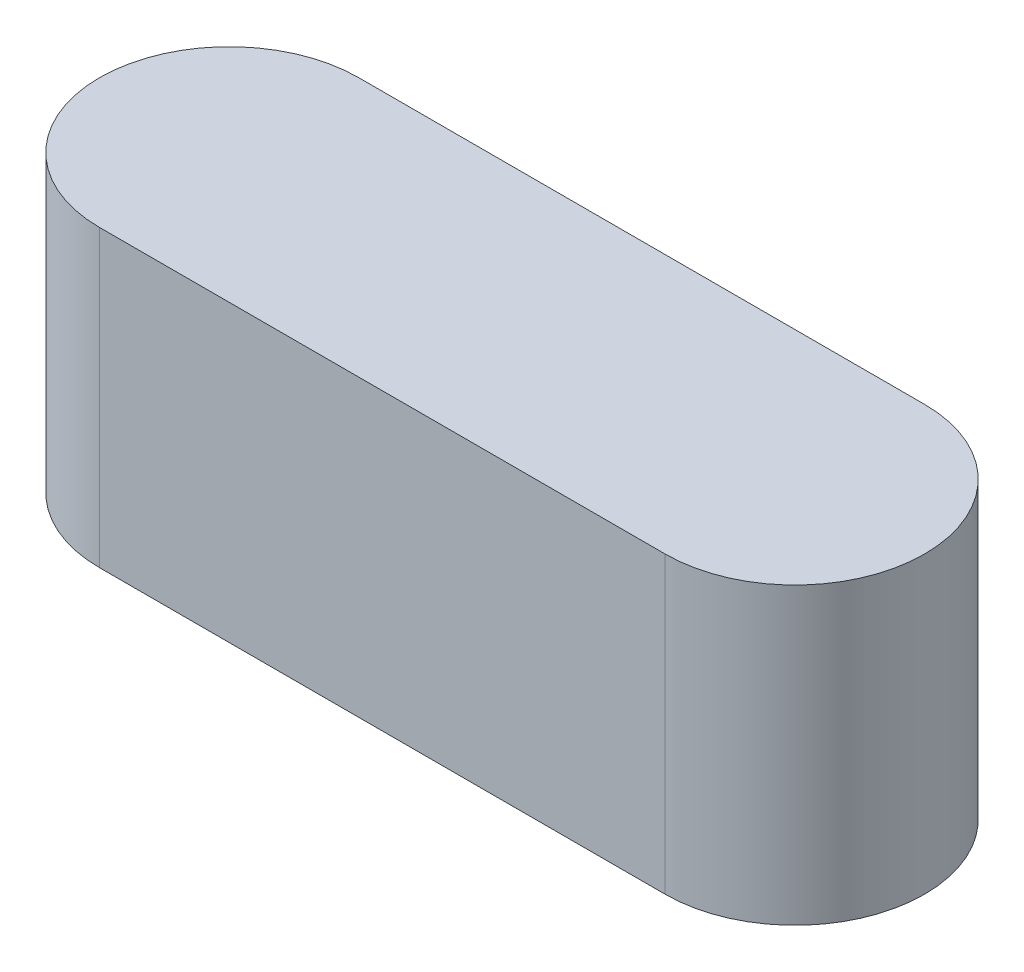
ISO-10303-21;
HEADER;
FILE_DESCRIPTION(('STEP AP214'),'2;1');
FILE_NAME('part.step','',(''),(''),'','','');
FILE_SCHEMA(('AUTOMOTIVE_DESIGN { 1 0 10303 214 1 1 1 1 }'));
ENDSEC;
DATA;
#1=APPLICATION_CONTEXT('core data for automotive mechanical design processes');
#2=APPLICATION_PROTOCOL_DEFINITION('international standard','automotive_design',2000,#1);
#3=PRODUCT_CONTEXT('',#1,'mechanical');
#4=PRODUCT('Part','Part','',(#3));
#5=PRODUCT_RELATED_PRODUCT_CATEGORY('part','',(#4));
#6=PRODUCT_DEFINITION_FORMATION('','',#4);
#7=PRODUCT_DEFINITION_CONTEXT('part definition',#1,'design');
#8=PRODUCT_DEFINITION('design','',#6,#7);
#9=PRODUCT_DEFINITION_SHAPE('','',#8);
#10=(LENGTH_UNIT() NAMED_UNIT(*) SI_UNIT(.MILLI.,.METRE.));
#11=(NAMED_UNIT(*) PLANE_ANGLE_UNIT() SI_UNIT($,.RADIAN.));
#12=(NAMED_UNIT(*) SI_UNIT($,.STERADIAN.) SOLID_ANGLE_UNIT());
#13=UNCERTAINTY_MEASURE_WITH_UNIT(LENGTH_MEASURE(1.E-05),#10,'distance_accuracy_value','');
#14=(GEOMETRIC_REPRESENTATION_CONTEXT(3) GLOBAL_UNCERTAINTY_ASSIGNED_CONTEXT((#13)) GLOBAL_UNIT_ASSIGNED_CONTEXT((#10,
#11,#12)) REPRESENTATION_CONTEXT('',''));
#15=CARTESIAN_POINT('',(0.,0.,0.));
#16=DIRECTION('',(0.,0.,1.));
#17=DIRECTION('',(1.,0.,0.));
#18=AXIS2_PLACEMENT_3D('',#15,#16,#17);
#19=CARTESIAN_POINT('',(24.,25.,0.));
#20=DIRECTION('',(0.,-1.,0.));
#21=DIRECTION('',(0.,0.,-1.));
#22=AXIS2_PLACEMENT_3D('',#19,#20,#21);
#23=CYLINDRICAL_SURFACE('',#22,11.);
#24=CARTESIAN_POINT('',(24.,0.,0.));
#25=DIRECTION('',(0.,1.,0.));
#26=DIRECTION('',(0.,0.,-1.));
#27=AXIS2_PLACEMENT_3D('',#24,#25,#26);
#28=CIRCLE('',#27,11.);
#29=CARTESIAN_POINT('',(24.,0.,11.));
#30=VERTEX_POINT('',#29);
#31=CARTESIAN_POINT('',(24.,0.,-11.));
#32=VERTEX_POINT('',#31);
#33=EDGE_CURVE('E94',#30,#32,#28,.T.);
#34=ORIENTED_EDGE('',*,*,#33,.T.);
#35=DIRECTION('',(0.,-1.,0.));
#36=VECTOR('',#35,1.);
#37=CARTESIAN_POINT('',(24.,25.,-11.));
#38=LINE('',#37,#36);
#39=CARTESIAN_POINT('',(24.,25.,-11.));
#40=VERTEX_POINT('',#39);
#41=EDGE_CURVE('E11',#40,#32,#38,.T.);
#42=ORIENTED_EDGE('',*,*,#41,.F.);
#43=CARTESIAN_POINT('',(24.,25.,0.));
#44=DIRECTION('',(0.,1.,0.));
#45=DIRECTION('',(0.,0.,-1.));
#46=AXIS2_PLACEMENT_3D('',#43,#44,#45);
#47=CIRCLE('',#46,11.);
#48=CARTESIAN_POINT('',(24.,25.,11.));
#49=VERTEX_POINT('',#48);
#50=EDGE_CURVE('E82',#49,#40,#47,.T.);
#51=ORIENTED_EDGE('',*,*,#50,.F.);
#52=DIRECTION('',(0.,-1.,0.));
#53=VECTOR('',#52,1.);
#54=CARTESIAN_POINT('',(24.,25.,11.));
#55=LINE('',#54,#53);
#56=EDGE_CURVE('E90',#49,#30,#55,.T.);
#57=ORIENTED_EDGE('',*,*,#56,.T.);
#58=EDGE_LOOP('',(#34,#42,#51,#57));
#59=FACE_BOUND('',#58,.T.);
#60=ADVANCED_FACE('F31',(#59),#23,.T.);
#61=CARTESIAN_POINT('',(-24.,25.,-11.));
#62=DIRECTION('',(0.,0.,1.));
#63=DIRECTION('',(1.,0.,0.));
#64=AXIS2_PLACEMENT_3D('',#61,#62,#63);
#65=PLANE('',#64);
#66=DIRECTION('',(-1.,0.,0.));
#67=VECTOR('',#66,1.);
#68=CARTESIAN_POINT('',(-24.,0.,-11.));
#69=LINE('',#68,#67);
#70=CARTESIAN_POINT('',(-24.,0.,-11.));
#71=VERTEX_POINT('',#70);
#72=EDGE_CURVE('E86',#32,#71,#69,.T.);
#73=ORIENTED_EDGE('',*,*,#72,.T.);
#74=DIRECTION('',(0.,-1.,0.));
#75=VECTOR('',#74,1.);
#76=CARTESIAN_POINT('',(-24.,25.,-11.));
#77=LINE('',#76,#75);
#78=CARTESIAN_POINT('',(-24.,25.,-11.));
#79=VERTEX_POINT('',#78);
#80=EDGE_CURVE('E39',#79,#71,#77,.T.);
#81=ORIENTED_EDGE('',*,*,#80,.F.);
#82=DIRECTION('',(-1.,0.,0.));
#83=VECTOR('',#82,1.);
#84=CARTESIAN_POINT('',(-24.,25.,-11.));
#85=LINE('',#84,#83);
#86=EDGE_CURVE('E77',#40,#79,#85,.T.);
#87=ORIENTED_EDGE('',*,*,#86,.F.);
#88=ORIENTED_EDGE('',*,*,#41,.T.);
#89=EDGE_LOOP('',(#73,#81,#87,#88));
#90=FACE_BOUND('',#89,.T.);
#91=ADVANCED_FACE('F85',(#90),#65,.F.);
#92=CARTESIAN_POINT('',(-24.,25.,0.));
#93=DIRECTION('',(0.,-1.,0.));
#94=DIRECTION('',(0.,0.,-1.));
#95=AXIS2_PLACEMENT_3D('',#92,#93,#94);
#96=CYLINDRICAL_SURFACE('',#95,11.);
#97=CARTESIAN_POINT('',(-24.,0.,0.));
#98=DIRECTION('',(0.,1.,0.));
#99=DIRECTION('',(0.,0.,-1.));
#100=AXIS2_PLACEMENT_3D('',#97,#98,#99);
#101=CIRCLE('',#100,11.);
#102=CARTESIAN_POINT('',(-24.,0.,11.));
#103=VERTEX_POINT('',#102);
#104=EDGE_CURVE('E64',#71,#103,#101,.T.);
#105=ORIENTED_EDGE('',*,*,#104,.T.);
#106=DIRECTION('',(0.,-1.,0.));
#107=VECTOR('',#106,1.);
#108=CARTESIAN_POINT('',(-24.,25.,11.));
#109=LINE('',#108,#107);
#110=CARTESIAN_POINT('',(-24.,25.,11.));
#111=VERTEX_POINT('',#110);
#112=EDGE_CURVE('E87',#111,#103,#109,.T.);
#113=ORIENTED_EDGE('',*,*,#112,.F.);
#114=CARTESIAN_POINT('',(-24.,25.,0.));
#115=DIRECTION('',(0.,1.,0.));
#116=DIRECTION('',(0.,0.,-1.));
#117=AXIS2_PLACEMENT_3D('',#114,#115,#116);
#118=CIRCLE('',#117,11.);
#119=EDGE_CURVE('E80',#79,#111,#118,.T.);
#120=ORIENTED_EDGE('',*,*,#119,.F.);
#121=ORIENTED_EDGE('',*,*,#80,.T.);
#122=EDGE_LOOP('',(#105,#113,#120,#121));
#123=FACE_BOUND('',#122,.T.);
#124=ADVANCED_FACE('F88',(#123),#96,.T.);
#125=CARTESIAN_POINT('',(24.,25.,11.));
#126=DIRECTION('',(0.,0.,-1.));
#127=DIRECTION('',(-1.,0.,0.));
#128=AXIS2_PLACEMENT_3D('',#125,#126,#127);
#129=PLANE('',#128);
#130=DIRECTION('',(1.,0.,0.));
#131=VECTOR('',#130,1.);
#132=CARTESIAN_POINT('',(24.,0.,11.));
#133=LINE('',#132,#131);
#134=EDGE_CURVE('E70',#103,#30,#133,.T.);
#135=ORIENTED_EDGE('',*,*,#134,.T.);
#136=ORIENTED_EDGE('',*,*,#56,.F.);
#137=DIRECTION('',(1.,0.,0.));
#138=VECTOR('',#137,1.);
#139=CARTESIAN_POINT('',(24.,25.,11.));
#140=LINE('',#139,#138);
#141=EDGE_CURVE('E47',#111,#49,#140,.T.);
#142=ORIENTED_EDGE('',*,*,#141,.F.);
#143=ORIENTED_EDGE('',*,*,#112,.T.);
#144=EDGE_LOOP('',(#135,#136,#142,#143));
#145=FACE_BOUND('',#144,.T.);
#146=ADVANCED_FACE('F101',(#145),#129,.F.);
#147=CARTESIAN_POINT('',(24.,25.,0.));
#148=DIRECTION('',(0.,-1.,0.));
#149=DIRECTION('',(0.,0.,-1.));
#150=AXIS2_PLACEMENT_3D('',#147,#148,#149);
#151=PLANE('',#150);
#152=ORIENTED_EDGE('',*,*,#50,.T.);
#153=ORIENTED_EDGE('',*,*,#86,.T.);
#154=ORIENTED_EDGE('',*,*,#119,.T.);
#155=ORIENTED_EDGE('',*,*,#141,.T.);
#156=EDGE_LOOP('',(#152,#153,#154,#155));
#157=FACE_BOUND('',#156,.T.);
#158=ADVANCED_FACE('F78',(#157),#151,.F.);
#159=CARTESIAN_POINT('',(24.,0.,0.));
#160=DIRECTION('',(0.,-1.,0.));
#161=DIRECTION('',(0.,0.,-1.));
#162=AXIS2_PLACEMENT_3D('',#159,#160,#161);
#163=PLANE('',#162);
#164=ORIENTED_EDGE('',*,*,#33,.F.);
#165=ORIENTED_EDGE('',*,*,#134,.F.);
#166=ORIENTED_EDGE('',*,*,#104,.F.);
#167=ORIENTED_EDGE('',*,*,#72,.F.);
#168=EDGE_LOOP('',(#164,#165,#166,#167));
#169=FACE_BOUND('',#168,.T.);
#170=ADVANCED_FACE('F104',(#169),#163,.T.);
#171=CLOSED_SHELL('',(#60,#91,#124,#146,#158,#170));
#172=MANIFOLD_SOLID_BREP('B2',#171);
#173=ADVANCED_BREP_SHAPE_REPRESENTATION('',(#18,#172),#14);
#174=SHAPE_DEFINITION_REPRESENTATION(#9,#173);
ENDSEC;
END-ISO-10303-21;
